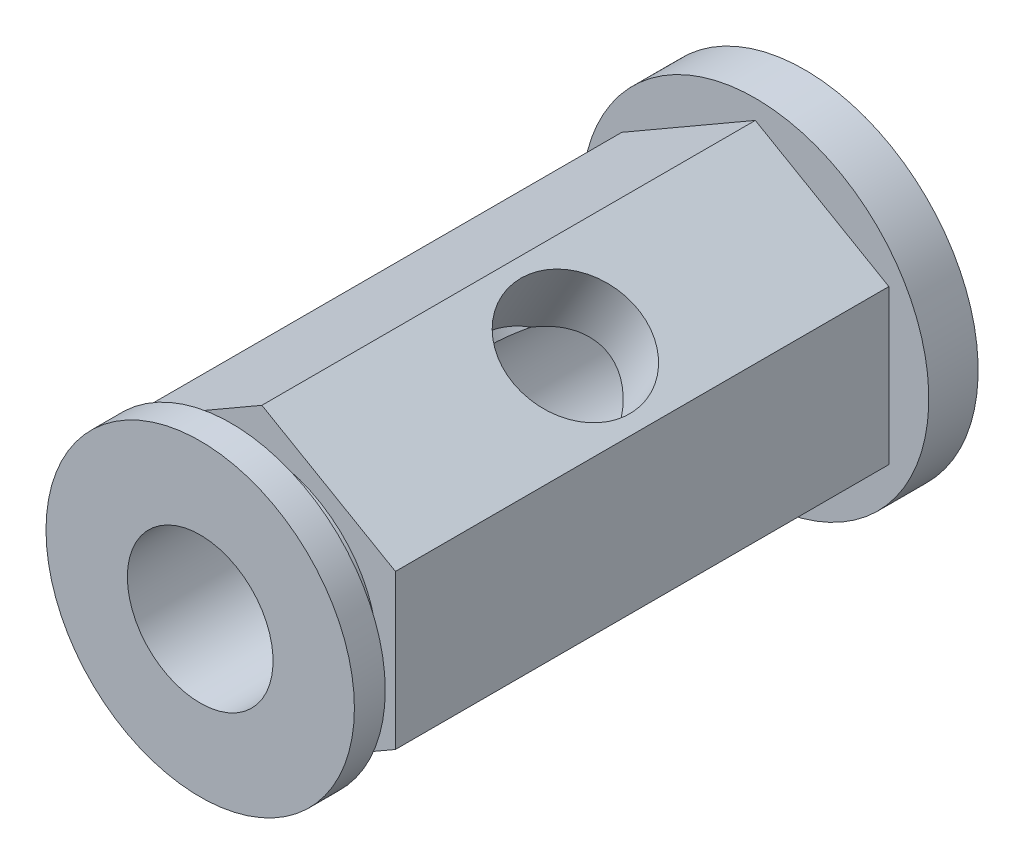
ISO-10303-21;
HEADER;
FILE_DESCRIPTION(('STEP AP214'),'2;1');
FILE_NAME('part.step','',(''),(''),'','','');
FILE_SCHEMA(('AUTOMOTIVE_DESIGN { 1 0 10303 214 1 1 1 1 }'));
ENDSEC;
DATA;
#1=APPLICATION_CONTEXT('core data for automotive mechanical design processes');
#2=APPLICATION_PROTOCOL_DEFINITION('international standard','automotive_design',2000,#1);
#3=PRODUCT_CONTEXT('',#1,'mechanical');
#4=PRODUCT('Part','Part','',(#3));
#5=PRODUCT_RELATED_PRODUCT_CATEGORY('part','',(#4));
#6=PRODUCT_DEFINITION_FORMATION('','',#4);
#7=PRODUCT_DEFINITION_CONTEXT('part definition',#1,'design');
#8=PRODUCT_DEFINITION('design','',#6,#7);
#9=PRODUCT_DEFINITION_SHAPE('','',#8);
#10=(LENGTH_UNIT() NAMED_UNIT(*) SI_UNIT(.MILLI.,.METRE.));
#11=(NAMED_UNIT(*) PLANE_ANGLE_UNIT() SI_UNIT($,.RADIAN.));
#12=(NAMED_UNIT(*) SI_UNIT($,.STERADIAN.) SOLID_ANGLE_UNIT());
#13=UNCERTAINTY_MEASURE_WITH_UNIT(LENGTH_MEASURE(1.E-05),#10,'distance_accuracy_value','');
#14=(GEOMETRIC_REPRESENTATION_CONTEXT(3) GLOBAL_UNCERTAINTY_ASSIGNED_CONTEXT((#13)) GLOBAL_UNIT_ASSIGNED_CONTEXT((#10,
#11,#12)) REPRESENTATION_CONTEXT('',''));
#15=CARTESIAN_POINT('',(0.,0.,0.));
#16=DIRECTION('',(0.,0.,1.));
#17=DIRECTION('',(1.,0.,0.));
#18=AXIS2_PLACEMENT_3D('',#15,#16,#17);
#19=CARTESIAN_POINT('',(0.,0.,20.32));
#20=DIRECTION('',(0.,0.,1.));
#21=DIRECTION('',(1.,0.,0.));
#22=AXIS2_PLACEMENT_3D('',#19,#20,#21);
#23=PLANE('',#22);
#24=DIRECTION('',(-0.866025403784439,0.5,0.));
#25=VECTOR('',#24,1.);
#26=CARTESIAN_POINT('',(5.49926131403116,3.17500000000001,20.32));
#27=LINE('',#26,#25);
#28=CARTESIAN_POINT('',(5.49926131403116,3.17500000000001,20.32));
#29=VERTEX_POINT('',#28);
#30=CARTESIAN_POINT('',(0.,6.35,20.32));
#31=VERTEX_POINT('',#30);
#32=EDGE_CURVE('E139',#29,#31,#27,.T.);
#33=ORIENTED_EDGE('',*,*,#32,.T.);
#34=DIRECTION('',(-0.866025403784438,-0.5,0.));
#35=VECTOR('',#34,1.);
#36=CARTESIAN_POINT('',(0.,6.35,20.32));
#37=LINE('',#36,#35);
#38=CARTESIAN_POINT('',(-5.49926131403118,3.175,20.32));
#39=VERTEX_POINT('',#38);
#40=EDGE_CURVE('E221',#31,#39,#37,.T.);
#41=ORIENTED_EDGE('',*,*,#40,.T.);
#42=DIRECTION('',(0.,-1.,0.));
#43=VECTOR('',#42,1.);
#44=CARTESIAN_POINT('',(-5.49926131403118,3.175,20.32));
#45=LINE('',#44,#43);
#46=CARTESIAN_POINT('',(-5.49926131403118,-3.175,20.32));
#47=VERTEX_POINT('',#46);
#48=EDGE_CURVE('E104',#39,#47,#45,.T.);
#49=ORIENTED_EDGE('',*,*,#48,.T.);
#50=DIRECTION('',(0.866025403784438,-0.5,0.));
#51=VECTOR('',#50,1.);
#52=CARTESIAN_POINT('',(-5.49926131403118,-3.175,20.32));
#53=LINE('',#52,#51);
#54=CARTESIAN_POINT('',(0.,-6.35000000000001,20.32));
#55=VERTEX_POINT('',#54);
#56=EDGE_CURVE('E97',#47,#55,#53,.T.);
#57=ORIENTED_EDGE('',*,*,#56,.T.);
#58=DIRECTION('',(0.866025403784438,0.500000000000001,0.));
#59=VECTOR('',#58,1.);
#60=CARTESIAN_POINT('',(0.,-6.35000000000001,20.32));
#61=LINE('',#60,#59);
#62=CARTESIAN_POINT('',(5.49926131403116,-3.17500000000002,20.32));
#63=VERTEX_POINT('',#62);
#64=EDGE_CURVE('E101',#55,#63,#61,.T.);
#65=ORIENTED_EDGE('',*,*,#64,.T.);
#66=DIRECTION('',(0.,1.,0.));
#67=VECTOR('',#66,1.);
#68=CARTESIAN_POINT('',(5.49926131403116,-3.17500000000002,20.32));
#69=LINE('',#68,#67);
#70=EDGE_CURVE('E63',#63,#29,#69,.T.);
#71=ORIENTED_EDGE('',*,*,#70,.T.);
#72=EDGE_LOOP('',(#33,#41,#49,#57,#65,#71));
#73=FACE_BOUND('',#72,.T.);
#74=CARTESIAN_POINT('',(0.,0.,20.32));
#75=DIRECTION('',(0.,0.,1.));
#76=DIRECTION('',(1.,0.,0.));
#77=AXIS2_PLACEMENT_3D('',#74,#75,#76);
#78=CIRCLE('',#77,4.73860566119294);
#79=CARTESIAN_POINT('',(4.73860566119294,0.,20.32));
#80=VERTEX_POINT('',#79);
#81=EDGE_CURVE('E207',#80,#80,#78,.T.);
#82=ORIENTED_EDGE('',*,*,#81,.F.);
#83=EDGE_LOOP('',(#82));
#84=FACE_BOUND('',#83,.T.);
#85=ADVANCED_FACE('F35',(#73,#84),#23,.T.);
#86=CARTESIAN_POINT('',(5.49926131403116,3.17500000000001,20.32));
#87=DIRECTION('',(-0.5,-0.866025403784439,0.));
#88=DIRECTION('',(0.866025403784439,-0.5,0.));
#89=AXIS2_PLACEMENT_3D('',#86,#87,#88);
#90=PLANE('',#89);
#91=CARTESIAN_POINT('',(2.74963065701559,4.7625,10.16));
#92=DIRECTION('',(0.5,0.866025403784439,0.));
#93=DIRECTION('',(-0.866025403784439,0.5,0.));
#94=AXIS2_PLACEMENT_3D('',#91,#92,#93);
#95=CIRCLE('',#94,2.59079999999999);
#96=CARTESIAN_POINT('',(0.50593204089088,6.05789999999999,10.16));
#97=VERTEX_POINT('',#96);
#98=EDGE_CURVE('E192',#97,#97,#95,.T.);
#99=ORIENTED_EDGE('',*,*,#98,.F.);
#100=EDGE_LOOP('',(#99));
#101=FACE_BOUND('',#100,.T.);
#102=DIRECTION('',(-0.866025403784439,0.5,0.));
#103=VECTOR('',#102,1.);
#104=CARTESIAN_POINT('',(5.49926131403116,3.17500000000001,0.));
#105=LINE('',#104,#103);
#106=CARTESIAN_POINT('',(5.49926131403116,3.17500000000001,0.));
#107=VERTEX_POINT('',#106);
#108=CARTESIAN_POINT('',(0.,6.35,0.));
#109=VERTEX_POINT('',#108);
#110=EDGE_CURVE('E76',#107,#109,#105,.T.);
#111=ORIENTED_EDGE('',*,*,#110,.T.);
#112=DIRECTION('',(0.,0.,-1.));
#113=VECTOR('',#112,1.);
#114=CARTESIAN_POINT('',(0.,6.35,20.32));
#115=LINE('',#114,#113);
#116=EDGE_CURVE('E147',#31,#109,#115,.T.);
#117=ORIENTED_EDGE('',*,*,#116,.F.);
#118=ORIENTED_EDGE('',*,*,#32,.F.);
#119=DIRECTION('',(0.,0.,-1.));
#120=VECTOR('',#119,1.);
#121=CARTESIAN_POINT('',(5.49926131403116,3.17500000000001,20.32));
#122=LINE('',#121,#120);
#123=EDGE_CURVE('E124',#29,#107,#122,.T.);
#124=ORIENTED_EDGE('',*,*,#123,.T.);
#125=EDGE_LOOP('',(#111,#117,#118,#124));
#126=FACE_BOUND('',#125,.T.);
#127=ADVANCED_FACE('F37',(#101,#126),#90,.F.);
#128=CARTESIAN_POINT('',(0.,6.35,20.32));
#129=DIRECTION('',(0.5,-0.866025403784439,0.));
#130=DIRECTION('',(0.866025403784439,0.5,0.));
#131=AXIS2_PLACEMENT_3D('',#128,#129,#130);
#132=PLANE('',#131);
#133=DIRECTION('',(-0.866025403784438,-0.5,0.));
#134=VECTOR('',#133,1.);
#135=CARTESIAN_POINT('',(0.,6.35,0.));
#136=LINE('',#135,#134);
#137=CARTESIAN_POINT('',(-5.49926131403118,3.175,0.));
#138=VERTEX_POINT('',#137);
#139=EDGE_CURVE('E85',#109,#138,#136,.T.);
#140=ORIENTED_EDGE('',*,*,#139,.T.);
#141=DIRECTION('',(0.,0.,-1.));
#142=VECTOR('',#141,1.);
#143=CARTESIAN_POINT('',(-5.49926131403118,3.175,20.32));
#144=LINE('',#143,#142);
#145=EDGE_CURVE('E144',#39,#138,#144,.T.);
#146=ORIENTED_EDGE('',*,*,#145,.F.);
#147=ORIENTED_EDGE('',*,*,#40,.F.);
#148=ORIENTED_EDGE('',*,*,#116,.T.);
#149=EDGE_LOOP('',(#140,#146,#147,#148));
#150=FACE_BOUND('',#149,.T.);
#151=ADVANCED_FACE('F226',(#150),#132,.F.);
#152=CARTESIAN_POINT('',(-5.49926131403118,3.175,20.32));
#153=DIRECTION('',(1.,0.,0.));
#154=DIRECTION('',(0.,0.,-1.));
#155=AXIS2_PLACEMENT_3D('',#152,#153,#154);
#156=PLANE('',#155);
#157=DIRECTION('',(0.,-1.,0.));
#158=VECTOR('',#157,1.);
#159=CARTESIAN_POINT('',(-5.49926131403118,3.175,0.));
#160=LINE('',#159,#158);
#161=CARTESIAN_POINT('',(-5.49926131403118,-3.175,0.));
#162=VERTEX_POINT('',#161);
#163=EDGE_CURVE('E131',#138,#162,#160,.T.);
#164=ORIENTED_EDGE('',*,*,#163,.T.);
#165=DIRECTION('',(0.,0.,-1.));
#166=VECTOR('',#165,1.);
#167=CARTESIAN_POINT('',(-5.49926131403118,-3.175,20.32));
#168=LINE('',#167,#166);
#169=EDGE_CURVE('E118',#47,#162,#168,.T.);
#170=ORIENTED_EDGE('',*,*,#169,.F.);
#171=ORIENTED_EDGE('',*,*,#48,.F.);
#172=ORIENTED_EDGE('',*,*,#145,.T.);
#173=EDGE_LOOP('',(#164,#170,#171,#172));
#174=FACE_BOUND('',#173,.T.);
#175=ADVANCED_FACE('F228',(#174),#156,.F.);
#176=CARTESIAN_POINT('',(-5.49926131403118,-3.175,20.32));
#177=DIRECTION('',(0.5,0.866025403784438,0.));
#178=DIRECTION('',(-0.866025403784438,0.5,0.));
#179=AXIS2_PLACEMENT_3D('',#176,#177,#178);
#180=PLANE('',#179);
#181=DIRECTION('',(0.866025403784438,-0.5,0.));
#182=VECTOR('',#181,1.);
#183=CARTESIAN_POINT('',(-5.49926131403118,-3.175,0.));
#184=LINE('',#183,#182);
#185=CARTESIAN_POINT('',(0.,-6.35000000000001,0.));
#186=VERTEX_POINT('',#185);
#187=EDGE_CURVE('E115',#162,#186,#184,.T.);
#188=ORIENTED_EDGE('',*,*,#187,.T.);
#189=DIRECTION('',(0.,0.,-1.));
#190=VECTOR('',#189,1.);
#191=CARTESIAN_POINT('',(0.,-6.35000000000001,20.32));
#192=LINE('',#191,#190);
#193=EDGE_CURVE('E111',#55,#186,#192,.T.);
#194=ORIENTED_EDGE('',*,*,#193,.F.);
#195=ORIENTED_EDGE('',*,*,#56,.F.);
#196=ORIENTED_EDGE('',*,*,#169,.T.);
#197=EDGE_LOOP('',(#188,#194,#195,#196));
#198=FACE_BOUND('',#197,.T.);
#199=ADVANCED_FACE('F112',(#198),#180,.F.);
#200=CARTESIAN_POINT('',(0.,-6.35000000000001,20.32));
#201=DIRECTION('',(-0.500000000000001,0.866025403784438,0.));
#202=DIRECTION('',(-0.866025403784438,-0.500000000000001,0.));
#203=AXIS2_PLACEMENT_3D('',#200,#201,#202);
#204=PLANE('',#203);
#205=DIRECTION('',(0.866025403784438,0.500000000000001,0.));
#206=VECTOR('',#205,1.);
#207=CARTESIAN_POINT('',(0.,-6.35000000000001,0.));
#208=LINE('',#207,#206);
#209=CARTESIAN_POINT('',(5.49926131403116,-3.17500000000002,0.));
#210=VERTEX_POINT('',#209);
#211=EDGE_CURVE('E135',#186,#210,#208,.T.);
#212=ORIENTED_EDGE('',*,*,#211,.T.);
#213=DIRECTION('',(0.,0.,-1.));
#214=VECTOR('',#213,1.);
#215=CARTESIAN_POINT('',(5.49926131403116,-3.17500000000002,20.32));
#216=LINE('',#215,#214);
#217=EDGE_CURVE('E119',#63,#210,#216,.T.);
#218=ORIENTED_EDGE('',*,*,#217,.F.);
#219=ORIENTED_EDGE('',*,*,#64,.F.);
#220=ORIENTED_EDGE('',*,*,#193,.T.);
#221=EDGE_LOOP('',(#212,#218,#219,#220));
#222=FACE_BOUND('',#221,.T.);
#223=ADVANCED_FACE('F121',(#222),#204,.F.);
#224=CARTESIAN_POINT('',(5.49926131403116,-3.17500000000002,20.32));
#225=DIRECTION('',(-1.,0.,0.));
#226=DIRECTION('',(0.,0.,1.));
#227=AXIS2_PLACEMENT_3D('',#224,#225,#226);
#228=PLANE('',#227);
#229=DIRECTION('',(0.,1.,0.));
#230=VECTOR('',#229,1.);
#231=CARTESIAN_POINT('',(5.49926131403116,-3.17500000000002,0.));
#232=LINE('',#231,#230);
#233=EDGE_CURVE('E137',#210,#107,#232,.T.);
#234=ORIENTED_EDGE('',*,*,#233,.T.);
#235=ORIENTED_EDGE('',*,*,#123,.F.);
#236=ORIENTED_EDGE('',*,*,#70,.F.);
#237=ORIENTED_EDGE('',*,*,#217,.T.);
#238=EDGE_LOOP('',(#234,#235,#236,#237));
#239=FACE_BOUND('',#238,.T.);
#240=ADVANCED_FACE('F236',(#239),#228,.F.);
#241=CARTESIAN_POINT('',(0.,0.,0.));
#242=DIRECTION('',(0.,0.,-1.));
#243=DIRECTION('',(-1.,0.,0.));
#244=AXIS2_PLACEMENT_3D('',#241,#242,#243);
#245=PLANE('',#244);
#246=CARTESIAN_POINT('',(0.,0.,0.));
#247=DIRECTION('',(0.,0.,-1.));
#248=DIRECTION('',(-1.,0.,0.));
#249=AXIS2_PLACEMENT_3D('',#246,#247,#248);
#250=CIRCLE('',#249,7.14375);
#251=CARTESIAN_POINT('',(-7.14375,0.,0.));
#252=VERTEX_POINT('',#251);
#253=EDGE_CURVE('E213',#252,#252,#250,.T.);
#254=ORIENTED_EDGE('',*,*,#253,.F.);
#255=EDGE_LOOP('',(#254));
#256=FACE_BOUND('',#255,.T.);
#257=ORIENTED_EDGE('',*,*,#139,.F.);
#258=ORIENTED_EDGE('',*,*,#110,.F.);
#259=ORIENTED_EDGE('',*,*,#233,.F.);
#260=ORIENTED_EDGE('',*,*,#211,.F.);
#261=ORIENTED_EDGE('',*,*,#187,.F.);
#262=ORIENTED_EDGE('',*,*,#163,.F.);
#263=EDGE_LOOP('',(#257,#258,#259,#260,#261,#262));
#264=FACE_BOUND('',#263,.T.);
#265=ADVANCED_FACE('F234',(#256,#264),#245,.F.);
#266=CARTESIAN_POINT('',(0.,0.,-2.032));
#267=DIRECTION('',(0.,0.,1.));
#268=DIRECTION('',(1.,0.,0.));
#269=AXIS2_PLACEMENT_3D('',#266,#267,#268);
#270=CYLINDRICAL_SURFACE('',#269,7.14375);
#271=CARTESIAN_POINT('',(0.,0.,-2.032));
#272=DIRECTION('',(0.,0.,-1.));
#273=DIRECTION('',(-1.,0.,0.));
#274=AXIS2_PLACEMENT_3D('',#271,#272,#273);
#275=CIRCLE('',#274,7.14375);
#276=CARTESIAN_POINT('',(-7.14375,0.,-2.032));
#277=VERTEX_POINT('',#276);
#278=EDGE_CURVE('E129',#277,#277,#275,.T.);
#279=ORIENTED_EDGE('',*,*,#278,.F.);
#280=EDGE_LOOP('',(#279));
#281=FACE_BOUND('',#280,.T.);
#282=ORIENTED_EDGE('',*,*,#253,.T.);
#283=EDGE_LOOP('',(#282));
#284=FACE_BOUND('',#283,.T.);
#285=ADVANCED_FACE('F250',(#281,#284),#270,.T.);
#286=CARTESIAN_POINT('',(0.,0.,-2.032));
#287=DIRECTION('',(0.,0.,-1.));
#288=DIRECTION('',(-1.,0.,0.));
#289=AXIS2_PLACEMENT_3D('',#286,#287,#288);
#290=PLANE('',#289);
#291=CARTESIAN_POINT('',(0.,0.,-2.032));
#292=DIRECTION('',(0.,0.,-1.));
#293=DIRECTION('',(-1.,0.,0.));
#294=AXIS2_PLACEMENT_3D('',#291,#292,#293);
#295=CIRCLE('',#294,3.);
#296=CARTESIAN_POINT('',(-3.,0.,-2.032));
#297=VERTEX_POINT('',#296);
#298=EDGE_CURVE('E194',#297,#297,#295,.T.);
#299=ORIENTED_EDGE('',*,*,#298,.F.);
#300=EDGE_LOOP('',(#299));
#301=FACE_BOUND('',#300,.T.);
#302=ORIENTED_EDGE('',*,*,#278,.T.);
#303=EDGE_LOOP('',(#302));
#304=FACE_BOUND('',#303,.T.);
#305=ADVANCED_FACE('F287',(#301,#304),#290,.T.);
#306=CARTESIAN_POINT('',(0.,0.,21.59));
#307=DIRECTION('',(0.,0.,-1.));
#308=DIRECTION('',(-1.,0.,0.));
#309=AXIS2_PLACEMENT_3D('',#306,#307,#308);
#310=CYLINDRICAL_SURFACE('',#309,4.73860566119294);
#311=CARTESIAN_POINT('',(0.,0.,21.59));
#312=DIRECTION('',(0.,0.,1.));
#313=DIRECTION('',(1.,0.,0.));
#314=AXIS2_PLACEMENT_3D('',#311,#312,#313);
#315=CIRCLE('',#314,4.73860566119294);
#316=CARTESIAN_POINT('',(4.73860566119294,0.,21.59));
#317=VERTEX_POINT('',#316);
#318=EDGE_CURVE('E210',#317,#317,#315,.T.);
#319=ORIENTED_EDGE('',*,*,#318,.F.);
#320=EDGE_LOOP('',(#319));
#321=FACE_BOUND('',#320,.T.);
#322=ORIENTED_EDGE('',*,*,#81,.T.);
#323=EDGE_LOOP('',(#322));
#324=FACE_BOUND('',#323,.T.);
#325=ADVANCED_FACE('F294',(#321,#324),#310,.T.);
#326=CARTESIAN_POINT('',(0.,0.,21.59));
#327=DIRECTION('',(0.,0.,1.));
#328=DIRECTION('',(1.,0.,0.));
#329=AXIS2_PLACEMENT_3D('',#326,#327,#328);
#330=PLANE('',#329);
#331=CARTESIAN_POINT('',(0.,0.,21.59));
#332=DIRECTION('',(0.,0.,1.));
#333=DIRECTION('',(1.,0.,0.));
#334=AXIS2_PLACEMENT_3D('',#331,#332,#333);
#335=CIRCLE('',#334,6.35);
#336=CARTESIAN_POINT('',(6.35,0.,21.59));
#337=VERTEX_POINT('',#336);
#338=EDGE_CURVE('E201',#337,#337,#335,.T.);
#339=ORIENTED_EDGE('',*,*,#338,.F.);
#340=EDGE_LOOP('',(#339));
#341=FACE_BOUND('',#340,.T.);
#342=ORIENTED_EDGE('',*,*,#318,.T.);
#343=EDGE_LOOP('',(#342));
#344=FACE_BOUND('',#343,.T.);
#345=ADVANCED_FACE('F304',(#341,#344),#330,.F.);
#346=CARTESIAN_POINT('',(0.,0.,22.86));
#347=DIRECTION('',(0.,0.,-1.));
#348=DIRECTION('',(-1.,0.,0.));
#349=AXIS2_PLACEMENT_3D('',#346,#347,#348);
#350=CYLINDRICAL_SURFACE('',#349,6.35);
#351=CARTESIAN_POINT('',(0.,0.,22.86));
#352=DIRECTION('',(0.,0.,1.));
#353=DIRECTION('',(1.,0.,0.));
#354=AXIS2_PLACEMENT_3D('',#351,#352,#353);
#355=CIRCLE('',#354,6.35);
#356=CARTESIAN_POINT('',(6.35,0.,22.86));
#357=VERTEX_POINT('',#356);
#358=EDGE_CURVE('E204',#357,#357,#355,.T.);
#359=ORIENTED_EDGE('',*,*,#358,.F.);
#360=EDGE_LOOP('',(#359));
#361=FACE_BOUND('',#360,.T.);
#362=ORIENTED_EDGE('',*,*,#338,.T.);
#363=EDGE_LOOP('',(#362));
#364=FACE_BOUND('',#363,.T.);
#365=ADVANCED_FACE('F312',(#361,#364),#350,.T.);
#366=CARTESIAN_POINT('',(0.,0.,22.86));
#367=DIRECTION('',(0.,0.,1.));
#368=DIRECTION('',(1.,0.,0.));
#369=AXIS2_PLACEMENT_3D('',#366,#367,#368);
#370=PLANE('',#369);
#371=CARTESIAN_POINT('',(0.,0.,22.86));
#372=DIRECTION('',(0.,0.,-1.));
#373=DIRECTION('',(-1.,0.,0.));
#374=AXIS2_PLACEMENT_3D('',#371,#372,#373);
#375=CIRCLE('',#374,3.);
#376=CARTESIAN_POINT('',(-3.,0.,22.86));
#377=VERTEX_POINT('',#376);
#378=EDGE_CURVE('E198',#377,#377,#375,.T.);
#379=ORIENTED_EDGE('',*,*,#378,.T.);
#380=EDGE_LOOP('',(#379));
#381=FACE_BOUND('',#380,.T.);
#382=ORIENTED_EDGE('',*,*,#358,.T.);
#383=EDGE_LOOP('',(#382));
#384=FACE_BOUND('',#383,.T.);
#385=ADVANCED_FACE('F319',(#381,#384),#370,.T.);
#386=CARTESIAN_POINT('',(0.,0.,22.86));
#387=DIRECTION('',(0.,0.,-1.));
#388=DIRECTION('',(-1.,0.,0.));
#389=AXIS2_PLACEMENT_3D('',#386,#387,#388);
#390=CYLINDRICAL_SURFACE('',#389,3.);
#391=CARTESIAN_POINT('',(2.86753767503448,0.881605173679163,8.5661989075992));
#392=CARTESIAN_POINT('',(2.84985679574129,0.939132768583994,8.50973607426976));
#393=CARTESIAN_POINT('',(2.82996159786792,0.997663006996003,8.45495742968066));
#394=CARTESIAN_POINT('',(2.78532979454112,1.11622028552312,8.34893496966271));
#395=CARTESIAN_POINT('',(2.76058634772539,1.1762493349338,8.29769628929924));
#396=CARTESIAN_POINT('',(2.70565887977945,1.29764707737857,8.1986593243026));
#397=CARTESIAN_POINT('',(2.67543002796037,1.35902284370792,8.15089430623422));
#398=CARTESIAN_POINT('',(2.60935704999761,1.48193219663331,8.05974317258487));
#399=CARTESIAN_POINT('',(2.5735162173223,1.54346566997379,8.01635451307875));
#400=CARTESIAN_POINT('',(2.47361399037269,1.70125343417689,7.91090428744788));
#401=CARTESIAN_POINT('',(2.40515464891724,1.79718602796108,7.8524006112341));
#402=CARTESIAN_POINT('',(2.25307675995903,1.98446448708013,7.75006273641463));
#403=CARTESIAN_POINT('',(2.16950581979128,2.0758236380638,7.70618366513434));
#404=CARTESIAN_POINT('',(2.03288624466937,2.20713470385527,7.65305055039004));
#405=CARTESIAN_POINT('',(1.98518157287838,2.25016621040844,7.63740446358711));
#406=CARTESIAN_POINT('',(1.88634541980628,2.33363993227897,7.61077240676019));
#407=CARTESIAN_POINT('',(1.83521567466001,2.37408343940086,7.59978409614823));
#408=CARTESIAN_POINT('',(1.72987020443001,2.45190482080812,7.58269887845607));
#409=CARTESIAN_POINT('',(1.67565371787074,2.48928193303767,7.57660318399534));
#410=CARTESIAN_POINT('',(1.56465934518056,2.5605072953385,7.56943802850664));
#411=CARTESIAN_POINT('',(1.50788181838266,2.59435603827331,7.56836786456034));
#412=CARTESIAN_POINT('',(1.35055510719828,2.68120687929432,7.57235926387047));
#413=CARTESIAN_POINT('',(1.24796630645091,2.73041910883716,7.58239901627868));
#414=CARTESIAN_POINT('',(1.04013453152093,2.81616493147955,7.61684629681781));
#415=CARTESIAN_POINT('',(0.934893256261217,2.85270642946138,7.64124484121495));
#416=CARTESIAN_POINT('',(0.724769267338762,2.91318641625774,7.70290210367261));
#417=CARTESIAN_POINT('',(0.619886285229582,2.93713886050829,7.74014650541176));
#418=CARTESIAN_POINT('',(0.412458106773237,2.97338270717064,7.82587273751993));
#419=CARTESIAN_POINT('',(0.309920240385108,2.9856414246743,7.8743855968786));
#420=CARTESIAN_POINT('',(0.128877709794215,2.99832373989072,7.97046125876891));
#421=CARTESIAN_POINT('',(0.0495940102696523,3.00059276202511,8.01635513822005));
#422=CARTESIAN_POINT('',(-0.105596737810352,2.9991458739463,8.11360615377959));
#423=CARTESIAN_POINT('',(-0.18150010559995,2.99542359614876,8.16496904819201));
#424=CARTESIAN_POINT('',(-0.328854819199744,2.98283184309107,8.27218711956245));
#425=CARTESIAN_POINT('',(-0.400331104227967,2.97399480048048,8.32801209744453));
#426=CARTESIAN_POINT('',(-0.538755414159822,2.95205924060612,8.44395485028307));
#427=CARTESIAN_POINT('',(-0.605713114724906,2.93897020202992,8.50406284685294));
#428=CARTESIAN_POINT('',(-0.670276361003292,2.92416305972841,8.5661989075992));
#429=B_SPLINE_CURVE_WITH_KNOTS('',3,(#391,#392,#393,#394,#395,#396,#397,#398,#399,#400,#401,
#402,#403,#404,#405,#406,#407,#408,#409,#410,#411,#412,#413,#414,#415,#416,#417,#418,#419,#420,
#421,#422,#423,#424,#425,#426,#427,#428),.UNSPECIFIED.,.F.,.F.,(4,2,2,2,2,2,2,2,2,2,2,2,2,2,2,2,
2,2,4),(0.,0.247547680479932,0.495447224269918,0.745472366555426,0.995351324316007,
1.38850511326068,1.78044123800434,1.97855276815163,2.17656462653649,2.37462554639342,
2.57265876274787,2.91349711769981,3.25412244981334,3.5943693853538,3.93556457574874,
4.21004691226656,4.48482116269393,4.75787187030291,5.03031801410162),.UNSPECIFIED.);
#430=CARTESIAN_POINT('',(2.86753767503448,0.881605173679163,8.5661989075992));
#431=VERTEX_POINT('',#430);
#432=CARTESIAN_POINT('',(-0.670276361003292,2.9241630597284,8.5661989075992));
#433=VERTEX_POINT('',#432);
#434=EDGE_CURVE('E48',#431,#433,#429,.T.);
#435=ORIENTED_EDGE('',*,*,#434,.T.);
#436=CARTESIAN_POINT('',(0.167615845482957,2.99531382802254,7.05084000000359));
#437=CARTESIAN_POINT('',(0.130093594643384,2.99740921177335,7.09619263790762));
#438=CARTESIAN_POINT('',(0.0935916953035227,2.99874924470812,7.14239925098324));
#439=CARTESIAN_POINT('',(0.0225662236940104,3.00012626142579,7.2362995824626));
#440=CARTESIAN_POINT('',(-0.0119581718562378,3.00016379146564,7.28399266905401));
#441=CARTESIAN_POINT('',(-0.112588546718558,2.99863715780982,7.42886203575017));
#442=CARTESIAN_POINT('',(-0.175880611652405,2.99543955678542,7.52798627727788));
#443=CARTESIAN_POINT('',(-0.295538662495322,2.98601209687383,7.73070685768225));
#444=CARTESIAN_POINT('',(-0.351874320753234,2.97976950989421,7.83432029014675));
#445=CARTESIAN_POINT('',(-0.457500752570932,2.96538919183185,8.04501537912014));
#446=CARTESIAN_POINT('',(-0.506787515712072,2.9572503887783,8.15209896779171));
#447=CARTESIAN_POINT('',(-0.601450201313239,2.93951312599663,8.37691577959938));
#448=CARTESIAN_POINT('',(-0.646300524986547,2.92985207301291,8.49486553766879));
#449=CARTESIAN_POINT('',(-0.727458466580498,2.9107631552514,8.73374308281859));
#450=CARTESIAN_POINT('',(-0.763762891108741,2.90133537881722,8.85467196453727));
#451=CARTESIAN_POINT('',(-0.827158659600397,2.88390174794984,9.09872061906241));
#452=CARTESIAN_POINT('',(-0.854272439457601,2.8758924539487,9.22183427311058));
#453=CARTESIAN_POINT('',(-0.898733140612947,2.86231035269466,9.46989504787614));
#454=CARTESIAN_POINT('',(-0.916085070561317,2.85673629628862,9.5948411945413));
#455=CARTESIAN_POINT('',(-0.941853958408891,2.84835502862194,9.86020321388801));
#456=CARTESIAN_POINT('',(-0.949024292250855,2.84593647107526,10.0007562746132));
#457=CARTESIAN_POINT('',(-0.950186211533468,2.84554834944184,10.2819286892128));
#458=CARTESIAN_POINT('',(-0.944176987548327,2.84757905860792,10.4225480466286));
#459=CARTESIAN_POINT('',(-0.9192430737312,2.85572398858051,10.702888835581));
#460=CARTESIAN_POINT('',(-0.90028269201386,2.86184949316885,10.8426067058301));
#461=CARTESIAN_POINT('',(-0.850203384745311,2.87712240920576,11.1196603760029));
#462=CARTESIAN_POINT('',(-0.819083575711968,2.88627004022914,11.2569960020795));
#463=CARTESIAN_POINT('',(-0.749516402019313,2.9050606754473,11.5140690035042));
#464=CARTESIAN_POINT('',(-0.712197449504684,2.91454803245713,11.6341270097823));
#465=CARTESIAN_POINT('',(-0.629122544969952,2.93360216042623,11.8712855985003));
#466=CARTESIAN_POINT('',(-0.58336613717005,2.94316893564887,11.988386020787));
#467=CARTESIAN_POINT('',(-0.483885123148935,2.96114937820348,12.2188270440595));
#468=CARTESIAN_POINT('',(-0.430184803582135,2.96956641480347,12.3321778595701));
#469=CARTESIAN_POINT('',(-0.314779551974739,2.98400630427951,12.5548407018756));
#470=CARTESIAN_POINT('',(-0.25307854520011,2.99003032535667,12.6641546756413));
#471=CARTESIAN_POINT('',(-0.133774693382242,2.9974975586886,12.8578244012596));
#472=CARTESIAN_POINT('',(-0.0775754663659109,2.99958823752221,12.9430143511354));
#473=CARTESIAN_POINT('',(0.0406080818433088,3.00029787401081,13.1093491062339));
#474=CARTESIAN_POINT('',(0.102595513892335,2.99891495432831,13.1904916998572));
#475=CARTESIAN_POINT('',(0.167615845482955,2.99531382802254,13.2691599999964));
#476=B_SPLINE_CURVE_WITH_KNOTS('',3,(#436,#437,#438,#439,#440,#441,#442,#443,#444,#445,#446,
#447,#448,#449,#450,#451,#452,#453,#454,#455,#456,#457,#458,#459,#460,#461,#462,#463,#464,#465,
#466,#467,#468,#469,#470,#471,#472,#473,#474,#475),.UNSPECIFIED.,.F.,.F.,(4,2,2,2,2,2,2,2,2,2,2,
2,2,2,2,2,2,2,2,4),(0.,0.176648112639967,0.353222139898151,0.705760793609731,1.05978585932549,
1.41401155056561,1.79337020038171,2.17287038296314,2.55143735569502,2.92980991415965,
3.35139122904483,3.77299843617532,4.19577225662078,4.61857680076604,4.99650247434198,
5.37444856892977,5.75126218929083,6.12789163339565,6.43384676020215,6.73996727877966),.UNSPECIFIED.);
#477=CARTESIAN_POINT('',(-0.670276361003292,2.9241630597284,11.7538010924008));
#478=VERTEX_POINT('',#477);
#479=EDGE_CURVE('E11',#433,#478,#476,.T.);
#480=ORIENTED_EDGE('',*,*,#479,.T.);
#481=CARTESIAN_POINT('',(-0.670276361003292,2.9241630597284,11.7538010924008));
#482=CARTESIAN_POINT('',(-0.611615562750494,2.93761476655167,11.8102639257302));
#483=CARTESIAN_POINT('',(-0.550979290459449,2.94965013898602,11.8650425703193));
#484=CARTESIAN_POINT('',(-0.425989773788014,2.97027650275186,11.9710650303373));
#485=CARTESIAN_POINT('',(-0.361631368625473,2.97886257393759,12.0223037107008));
#486=CARTESIAN_POINT('',(-0.229034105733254,2.99199286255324,12.1213406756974));
#487=CARTESIAN_POINT('',(-0.160766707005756,2.99650179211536,12.1691056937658));
#488=CARTESIAN_POINT('',(-0.0212875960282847,3.0007355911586,12.2602568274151));
#489=CARTESIAN_POINT('',(0.0499223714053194,3.00046325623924,12.3036454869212));
#490=CARTESIAN_POINT('',(0.236521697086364,2.99283927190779,12.4090957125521));
#491=CARTESIAN_POINT('',(0.353831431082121,2.98151803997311,12.4675993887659));
#492=CARTESIAN_POINT('',(0.592058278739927,2.94345395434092,12.5699372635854));
#493=CARTESIAN_POINT('',(0.712963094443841,2.91675897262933,12.6138163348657));
#494=CARTESIAN_POINT('',(0.894991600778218,2.86409848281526,12.66694944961));
#495=CARTESIAN_POINT('',(0.956110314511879,2.84430077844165,12.6825955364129));
#496=CARTESIAN_POINT('',(1.07781875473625,2.80044302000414,12.7092275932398));
#497=CARTESIAN_POINT('',(1.13840873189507,2.77638511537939,12.7202159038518));
#498=CARTESIAN_POINT('',(1.25847676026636,2.72406395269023,12.7373011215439));
#499=CARTESIAN_POINT('',(1.31795453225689,2.69579965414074,12.7433968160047));
#500=CARTESIAN_POINT('',(1.43513469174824,2.63528838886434,12.7505619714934));
#501=CARTESIAN_POINT('',(1.49283732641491,2.60304197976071,12.7516321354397));
#502=CARTESIAN_POINT('',(1.64671571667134,2.51021847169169,12.7476407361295));
#503=CARTESIAN_POINT('',(1.74062915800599,2.44598007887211,12.7376009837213));
#504=CARTESIAN_POINT('',(1.91880310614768,2.30886539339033,12.7031537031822));
#505=CARTESIAN_POINT('',(2.00306960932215,2.23599452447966,12.6787551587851));
#506=CARTESIAN_POINT('',(2.16050880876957,2.08426180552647,12.6170978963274));
#507=CARTESIAN_POINT('',(2.23369372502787,2.00540670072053,12.5798534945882));
#508=CARTESIAN_POINT('',(2.3687959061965,1.84389055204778,12.4941272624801));
#509=CARTESIAN_POINT('',(2.43068120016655,1.76121951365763,12.4456144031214));
#510=CARTESIAN_POINT('',(2.53218567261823,1.61077324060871,12.3495387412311));
#511=CARTESIAN_POINT('',(2.57379255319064,1.54324605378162,12.30364486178));
#512=CARTESIAN_POINT('',(2.65013488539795,1.40812347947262,12.2063938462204));
#513=CARTESIAN_POINT('',(2.68486298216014,1.34052809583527,12.155030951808));
#514=CARTESIAN_POINT('',(2.7476355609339,1.20661929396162,12.0478128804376));
#515=CARTESIAN_POINT('',(2.77572060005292,1.14030049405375,11.9919879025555));
#516=CARTESIAN_POINT('',(2.82593600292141,1.00945374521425,11.8760451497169));
#517=CARTESIAN_POINT('',(2.84807941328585,0.944922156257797,11.8159371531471));
#518=CARTESIAN_POINT('',(2.86753767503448,0.881605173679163,11.7538010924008));
#519=B_SPLINE_CURVE_WITH_KNOTS('',3,(#481,#482,#483,#484,#485,#486,#487,#488,#489,#490,#491,
#492,#493,#494,#495,#496,#497,#498,#499,#500,#501,#502,#503,#504,#505,#506,#507,#508,#509,#510,
#511,#512,#513,#514,#515,#516,#517,#518),.UNSPECIFIED.,.F.,.F.,(4,2,2,2,2,2,2,2,2,2,2,2,2,2,2,2,
2,2,4),(0.,0.247547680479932,0.495447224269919,0.745472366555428,0.99535132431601,
1.38850511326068,1.78044123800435,1.97855276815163,2.17656462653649,2.37462554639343,
2.57265876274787,2.91349711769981,3.25412244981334,3.59436938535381,3.93556457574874,
4.21004691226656,4.48482116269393,4.75787187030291,5.03031801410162),.UNSPECIFIED.);
#520=CARTESIAN_POINT('',(2.86753767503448,0.881605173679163,11.7538010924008));
#521=VERTEX_POINT('',#520);
#522=EDGE_CURVE('E155',#478,#521,#519,.T.);
#523=ORIENTED_EDGE('',*,*,#522,.T.);
#524=CARTESIAN_POINT('',(2.44588494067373,1.73713754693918,13.4004069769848));
#525=CARTESIAN_POINT('',(2.45721906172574,1.72117922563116,13.3790013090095));
#526=CARTESIAN_POINT('',(2.46823615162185,1.70533669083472,13.3573466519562));
#527=CARTESIAN_POINT('',(2.48966583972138,1.67389515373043,13.3135857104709));
#528=CARTESIAN_POINT('',(2.50007874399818,1.65829603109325,13.2914796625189));
#529=CARTESIAN_POINT('',(2.55124803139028,1.58011409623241,13.1787505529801));
#530=CARTESIAN_POINT('',(2.58766395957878,1.51937384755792,13.0848361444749));
#531=CARTESIAN_POINT('',(2.65298705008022,1.40219713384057,12.8917971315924));
#532=CARTESIAN_POINT('',(2.68188532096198,1.34576582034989,12.7926665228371));
#533=CARTESIAN_POINT('',(2.7336206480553,1.23731279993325,12.5897889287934));
#534=CARTESIAN_POINT('',(2.75642456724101,1.18531620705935,12.486020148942));
#535=CARTESIAN_POINT('',(2.7968328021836,1.08654043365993,12.2751068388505));
#536=CARTESIAN_POINT('',(2.81443888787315,1.03975948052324,12.1679634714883));
#537=CARTESIAN_POINT('',(2.84643392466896,0.948840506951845,11.9429728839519));
#538=CARTESIAN_POINT('',(2.86050363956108,0.905129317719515,11.8249074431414));
#539=CARTESIAN_POINT('',(2.88456325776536,0.825248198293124,11.5858258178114));
#540=CARTESIAN_POINT('',(2.89455273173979,0.78907906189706,11.4648093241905));
#541=CARTESIAN_POINT('',(2.91113884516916,0.725498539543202,11.2207911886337));
#542=CARTESIAN_POINT('',(2.91774943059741,0.698051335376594,11.0977999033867));
#543=CARTESIAN_POINT('',(2.92820503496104,0.65280631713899,10.8499428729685));
#544=CARTESIAN_POINT('',(2.93205046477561,0.635007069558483,10.7250774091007));
#545=CARTESIAN_POINT('',(2.93767446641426,0.608509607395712,10.459812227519));
#546=CARTESIAN_POINT('',(2.93916509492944,0.601090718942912,10.3192747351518));
#547=CARTESIAN_POINT('',(2.93941051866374,0.599887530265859,10.03812984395));
#548=CARTESIAN_POINT('',(2.93816507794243,0.606104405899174,9.89752244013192));
#549=CARTESIAN_POINT('',(2.93275294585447,0.631765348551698,9.61717884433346));
#550=CARTESIAN_POINT('',(2.92857763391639,0.651248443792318,9.47744645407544));
#551=CARTESIAN_POINT('',(2.91676422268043,0.702257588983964,9.20036525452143));
#552=CARTESIAN_POINT('',(2.90912590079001,0.733784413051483,9.06301659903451));
#553=CARTESIAN_POINT('',(2.89062054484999,0.803407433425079,8.80601467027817));
#554=CARTESIAN_POINT('',(2.88018568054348,0.840441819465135,8.68603868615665));
#555=CARTESIAN_POINT('',(2.85517264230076,0.921847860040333,8.44903843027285));
#556=CARTESIAN_POINT('',(2.84059421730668,0.96621995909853,8.33201433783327));
#557=CARTESIAN_POINT('',(2.80643836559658,1.06134582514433,8.1015639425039));
#558=CARTESIAN_POINT('',(2.78686908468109,1.11208912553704,7.98813211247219));
#559=CARTESIAN_POINT('',(2.74165096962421,1.21931946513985,7.76530587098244));
#560=CARTESIAN_POINT('',(2.71600519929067,1.27580360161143,7.65590945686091));
#561=CARTESIAN_POINT('',(2.66275942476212,1.38296388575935,7.4620590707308));
#562=CARTESIAN_POINT('',(2.63642221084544,1.4327502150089,7.37676709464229));
#563=CARTESIAN_POINT('',(2.57794881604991,1.53547059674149,7.21039572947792));
#564=CARTESIAN_POINT('',(2.54582612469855,1.58839713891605,7.12930709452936));
#565=CARTESIAN_POINT('',(2.48629425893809,1.67935820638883,6.99815062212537));
#566=CARTESIAN_POINT('',(2.46080339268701,1.71657301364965,6.9466432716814));
#567=CARTESIAN_POINT('',(2.40625706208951,1.7922334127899,6.84653966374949));
#568=CARTESIAN_POINT('',(2.37720383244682,1.83067822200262,6.79794160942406));
#569=CARTESIAN_POINT('',(2.31474999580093,1.90905032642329,6.70385759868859));
#570=CARTESIAN_POINT('',(2.28131051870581,1.94898827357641,6.65840579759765));
#571=CARTESIAN_POINT('',(2.20970066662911,2.02980782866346,6.57205562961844));
#572=CARTESIAN_POINT('',(2.17151852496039,2.0706915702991,6.53116908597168));
#573=CARTESIAN_POINT('',(2.13074648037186,2.1118521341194,6.4931471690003));
#574=B_SPLINE_CURVE_WITH_KNOTS('',3,(#524,#525,#526,#527,#528,#529,#530,#531,#532,#533,#534,
#535,#536,#537,#538,#539,#540,#541,#542,#543,#544,#545,#546,#547,#548,#549,#550,#551,#552,#553,
#554,#555,#556,#557,#558,#559,#560,#561,#562,#563,#564,#565,#566,#567,#568,#569,#570,#571,#572,
#573),.UNSPECIFIED.,.F.,.F.,(4,2,2,2,2,2,2,2,2,2,2,2,2,2,2,2,2,2,2,2,2,2,2,2,4),(0.,
0.0870072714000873,0.173970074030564,0.52622714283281,0.878898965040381,1.23345106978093,
1.58788230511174,1.96760618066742,2.34737000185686,2.72555347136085,3.10368073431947,
3.52521558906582,3.94678679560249,4.36960362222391,4.79244763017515,5.17011286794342,
5.5478009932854,5.92487657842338,6.30176244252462,6.60815297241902,6.91383815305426,
7.11910078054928,7.32423529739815,7.5313289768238,7.73894712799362),.UNSPECIFIED.);
#575=EDGE_CURVE('E149',#521,#431,#574,.T.);
#576=ORIENTED_EDGE('',*,*,#575,.T.);
#577=EDGE_LOOP('',(#435,#480,#523,#576));
#578=FACE_BOUND('',#577,.T.);
#579=ORIENTED_EDGE('',*,*,#378,.F.);
#580=EDGE_LOOP('',(#579));
#581=FACE_BOUND('',#580,.T.);
#582=ORIENTED_EDGE('',*,*,#298,.T.);
#583=EDGE_LOOP('',(#582));
#584=FACE_BOUND('',#583,.T.);
#585=ADVANCED_FACE('F160',(#578,#581,#584),#390,.F.);
#586=CARTESIAN_POINT('',(2.74963065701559,4.7625,10.16));
#587=DIRECTION('',(0.5,0.866025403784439,0.));
#588=DIRECTION('',(-0.866025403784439,0.5,0.));
#589=AXIS2_PLACEMENT_3D('',#586,#587,#588);
#590=CYLINDRICAL_SURFACE('',#589,2.59079999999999);
#591=ORIENTED_EDGE('',*,*,#98,.T.);
#592=EDGE_LOOP('',(#591));
#593=FACE_BOUND('',#592,.T.);
#594=CARTESIAN_POINT('',(1.09863065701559,1.90288411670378,10.16));
#595=DIRECTION('',(0.5,0.866025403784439,0.));
#596=DIRECTION('',(-0.866025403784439,0.5,0.));
#597=AXIS2_PLACEMENT_3D('',#594,#595,#596);
#598=CIRCLE('',#597,2.59079999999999);
#599=EDGE_CURVE('E54',#521,#431,#598,.T.);
#600=ORIENTED_EDGE('',*,*,#599,.F.);
#601=ORIENTED_EDGE('',*,*,#522,.F.);
#602=EDGE_CURVE('E190',#433,#478,#598,.T.);
#603=ORIENTED_EDGE('',*,*,#602,.F.);
#604=ORIENTED_EDGE('',*,*,#434,.F.);
#605=EDGE_LOOP('',(#600,#601,#603,#604));
#606=FACE_BOUND('',#605,.T.);
#607=ADVANCED_FACE('F167',(#593,#606),#590,.F.);
#608=CARTESIAN_POINT('',(1.09863065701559,1.90288411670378,10.16));
#609=DIRECTION('',(0.5,0.866025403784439,0.));
#610=DIRECTION('',(-0.866025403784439,0.5,0.));
#611=AXIS2_PLACEMENT_3D('',#608,#609,#610);
#612=CONICAL_SURFACE('',#611,2.59079999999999,1.02974425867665);
#613=ORIENTED_EDGE('',*,*,#602,.T.);
#614=ORIENTED_EDGE('',*,*,#479,.F.);
#615=EDGE_LOOP('',(#613,#614));
#616=FACE_BOUND('',#615,.T.);
#617=ADVANCED_FACE('F163',(#616),#612,.F.);
#618=ORIENTED_EDGE('',*,*,#599,.T.);
#619=ORIENTED_EDGE('',*,*,#575,.F.);
#620=EDGE_LOOP('',(#618,#619));
#621=FACE_BOUND('',#620,.T.);
#622=ADVANCED_FACE('F166',(#621),#612,.F.);
#623=CLOSED_SHELL('',(#85,#127,#151,#175,#199,#223,#240,#265,#285,#305,#325,#345,#365,#385,#585,
#607,#617,#622));
#624=MANIFOLD_SOLID_BREP('B2',#623);
#625=ADVANCED_BREP_SHAPE_REPRESENTATION('',(#18,#624),#14);
#626=SHAPE_DEFINITION_REPRESENTATION(#9,#625);
ENDSEC;
END-ISO-10303-21;
